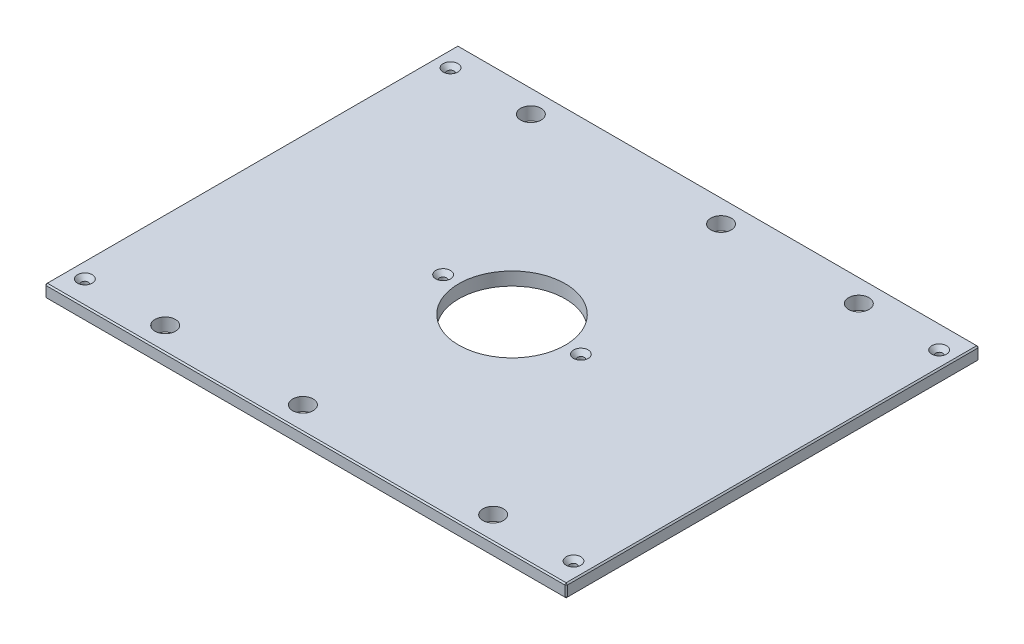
ISO-10303-21;
HEADER;
FILE_DESCRIPTION(('STEP AP214'),'2;1');
FILE_NAME('part.step','',(''),(''),'','','');
FILE_SCHEMA(('AUTOMOTIVE_DESIGN { 1 0 10303 214 1 1 1 1 }'));
ENDSEC;
DATA;
#1=APPLICATION_CONTEXT('core data for automotive mechanical design processes');
#2=APPLICATION_PROTOCOL_DEFINITION('international standard','automotive_design',2000,#1);
#3=PRODUCT_CONTEXT('',#1,'mechanical');
#4=PRODUCT('Part','Part','',(#3));
#5=PRODUCT_RELATED_PRODUCT_CATEGORY('part','',(#4));
#6=PRODUCT_DEFINITION_FORMATION('','',#4);
#7=PRODUCT_DEFINITION_CONTEXT('part definition',#1,'design');
#8=PRODUCT_DEFINITION('design','',#6,#7);
#9=PRODUCT_DEFINITION_SHAPE('','',#8);
#10=(LENGTH_UNIT() NAMED_UNIT(*) SI_UNIT(.MILLI.,.METRE.));
#11=(NAMED_UNIT(*) PLANE_ANGLE_UNIT() SI_UNIT($,.RADIAN.));
#12=(NAMED_UNIT(*) SI_UNIT($,.STERADIAN.) SOLID_ANGLE_UNIT());
#13=UNCERTAINTY_MEASURE_WITH_UNIT(LENGTH_MEASURE(1.E-05),#10,'distance_accuracy_value','');
#14=(GEOMETRIC_REPRESENTATION_CONTEXT(3) GLOBAL_UNCERTAINTY_ASSIGNED_CONTEXT((#13)) GLOBAL_UNIT_ASSIGNED_CONTEXT((#10,
#11,#12)) REPRESENTATION_CONTEXT('',''));
#15=CARTESIAN_POINT('',(0.,0.,0.));
#16=DIRECTION('',(0.,0.,1.));
#17=DIRECTION('',(1.,0.,0.));
#18=AXIS2_PLACEMENT_3D('',#15,#16,#17);
#19=CARTESIAN_POINT('',(-252.4125,12.7,-200.025));
#20=DIRECTION('',(1.,0.,0.));
#21=DIRECTION('',(0.,0.,-1.));
#22=AXIS2_PLACEMENT_3D('',#19,#20,#21);
#23=PLANE('',#22);
#24=DIRECTION('',(0.,0.,-1.));
#25=VECTOR('',#24,1.);
#26=CARTESIAN_POINT('',(-252.4125,11.4299999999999,-200.025));
#27=LINE('',#26,#25);
#28=CARTESIAN_POINT('',(-252.4125,11.4299999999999,198.755));
#29=VERTEX_POINT('',#28);
#30=CARTESIAN_POINT('',(-252.4125,11.4299999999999,-198.755));
#31=VERTEX_POINT('',#30);
#32=EDGE_CURVE('E135',#29,#31,#27,.T.);
#33=ORIENTED_EDGE('',*,*,#32,.T.);
#34=DIRECTION('',(0.,-1.,0.));
#35=VECTOR('',#34,1.);
#36=CARTESIAN_POINT('',(-252.4125,12.7,-198.755));
#37=LINE('',#36,#35);
#38=CARTESIAN_POINT('',(-252.4125,1.27000000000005,-198.755));
#39=VERTEX_POINT('',#38);
#40=EDGE_CURVE('E131',#31,#39,#37,.T.);
#41=ORIENTED_EDGE('',*,*,#40,.T.);
#42=DIRECTION('',(0.,0.,1.));
#43=VECTOR('',#42,1.);
#44=CARTESIAN_POINT('',(-252.4125,1.27000000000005,-200.025));
#45=LINE('',#44,#43);
#46=CARTESIAN_POINT('',(-252.4125,1.27000000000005,198.755));
#47=VERTEX_POINT('',#46);
#48=EDGE_CURVE('E126',#39,#47,#45,.T.);
#49=ORIENTED_EDGE('',*,*,#48,.T.);
#50=DIRECTION('',(0.,1.,0.));
#51=VECTOR('',#50,1.);
#52=CARTESIAN_POINT('',(-252.4125,12.7,198.755));
#53=LINE('',#52,#51);
#54=EDGE_CURVE('E128',#47,#29,#53,.T.);
#55=ORIENTED_EDGE('',*,*,#54,.T.);
#56=EDGE_LOOP('',(#33,#41,#49,#55));
#57=FACE_BOUND('',#56,.T.);
#58=ADVANCED_FACE('F35',(#57),#23,.F.);
#59=CARTESIAN_POINT('',(-252.4125,12.7,200.025));
#60=DIRECTION('',(0.,0.,-1.));
#61=DIRECTION('',(-1.,0.,0.));
#62=AXIS2_PLACEMENT_3D('',#59,#60,#61);
#63=PLANE('',#62);
#64=DIRECTION('',(1.,0.,0.));
#65=VECTOR('',#64,1.);
#66=CARTESIAN_POINT('',(-252.4125,1.26999999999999,200.025));
#67=LINE('',#66,#65);
#68=CARTESIAN_POINT('',(-251.1425,1.26999999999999,200.025));
#69=VERTEX_POINT('',#68);
#70=CARTESIAN_POINT('',(251.1425,1.26999999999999,200.025));
#71=VERTEX_POINT('',#70);
#72=EDGE_CURVE('E58',#69,#71,#67,.T.);
#73=ORIENTED_EDGE('',*,*,#72,.T.);
#74=DIRECTION('',(0.,1.,0.));
#75=VECTOR('',#74,1.);
#76=CARTESIAN_POINT('',(251.1425,12.7,200.025));
#77=LINE('',#76,#75);
#78=CARTESIAN_POINT('',(251.1425,11.43,200.025));
#79=VERTEX_POINT('',#78);
#80=EDGE_CURVE('E11',#71,#79,#77,.T.);
#81=ORIENTED_EDGE('',*,*,#80,.T.);
#82=DIRECTION('',(-1.,0.,0.));
#83=VECTOR('',#82,1.);
#84=CARTESIAN_POINT('',(-252.4125,11.43,200.025));
#85=LINE('',#84,#83);
#86=CARTESIAN_POINT('',(-251.1425,11.43,200.025));
#87=VERTEX_POINT('',#86);
#88=EDGE_CURVE('E44',#79,#87,#85,.T.);
#89=ORIENTED_EDGE('',*,*,#88,.T.);
#90=DIRECTION('',(0.,-1.,0.));
#91=VECTOR('',#90,1.);
#92=CARTESIAN_POINT('',(-251.1425,12.7,200.025));
#93=LINE('',#92,#91);
#94=EDGE_CURVE('E291',#87,#69,#93,.T.);
#95=ORIENTED_EDGE('',*,*,#94,.T.);
#96=EDGE_LOOP('',(#73,#81,#89,#95));
#97=FACE_BOUND('',#96,.T.);
#98=ADVANCED_FACE('F360',(#97),#63,.F.);
#99=CARTESIAN_POINT('',(252.4125,12.7,-200.025));
#100=DIRECTION('',(-1.,0.,0.));
#101=DIRECTION('',(0.,0.,1.));
#102=AXIS2_PLACEMENT_3D('',#99,#100,#101);
#103=PLANE('',#102);
#104=DIRECTION('',(0.,0.,-1.));
#105=VECTOR('',#104,1.);
#106=CARTESIAN_POINT('',(252.4125,1.26999999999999,-200.025));
#107=LINE('',#106,#105);
#108=CARTESIAN_POINT('',(252.4125,1.26999999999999,198.755));
#109=VERTEX_POINT('',#108);
#110=CARTESIAN_POINT('',(252.4125,1.26999999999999,-198.755));
#111=VERTEX_POINT('',#110);
#112=EDGE_CURVE('E286',#109,#111,#107,.T.);
#113=ORIENTED_EDGE('',*,*,#112,.T.);
#114=DIRECTION('',(0.,1.,0.));
#115=VECTOR('',#114,1.);
#116=CARTESIAN_POINT('',(252.4125,12.7,-198.755));
#117=LINE('',#116,#115);
#118=CARTESIAN_POINT('',(252.4125,11.4299999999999,-198.755));
#119=VERTEX_POINT('',#118);
#120=EDGE_CURVE('E288',#111,#119,#117,.T.);
#121=ORIENTED_EDGE('',*,*,#120,.T.);
#122=DIRECTION('',(0.,0.,1.));
#123=VECTOR('',#122,1.);
#124=CARTESIAN_POINT('',(252.4125,11.4299999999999,200.025));
#125=LINE('',#124,#123);
#126=CARTESIAN_POINT('',(252.4125,11.4299999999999,198.755));
#127=VERTEX_POINT('',#126);
#128=EDGE_CURVE('E284',#119,#127,#125,.T.);
#129=ORIENTED_EDGE('',*,*,#128,.T.);
#130=DIRECTION('',(0.,-1.,0.));
#131=VECTOR('',#130,1.);
#132=CARTESIAN_POINT('',(252.4125,12.7,198.755));
#133=LINE('',#132,#131);
#134=EDGE_CURVE('E282',#127,#109,#133,.T.);
#135=ORIENTED_EDGE('',*,*,#134,.T.);
#136=EDGE_LOOP('',(#113,#121,#129,#135));
#137=FACE_BOUND('',#136,.T.);
#138=ADVANCED_FACE('F347',(#137),#103,.F.);
#139=CARTESIAN_POINT('',(-252.4125,12.7,-200.025));
#140=DIRECTION('',(0.,0.,1.));
#141=DIRECTION('',(1.,0.,0.));
#142=AXIS2_PLACEMENT_3D('',#139,#140,#141);
#143=PLANE('',#142);
#144=DIRECTION('',(-1.,0.,0.));
#145=VECTOR('',#144,1.);
#146=CARTESIAN_POINT('',(-252.4125,1.26999999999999,-200.025));
#147=LINE('',#146,#145);
#148=CARTESIAN_POINT('',(251.1425,1.26999999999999,-200.025));
#149=VERTEX_POINT('',#148);
#150=CARTESIAN_POINT('',(-251.1425,1.26999999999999,-200.025));
#151=VERTEX_POINT('',#150);
#152=EDGE_CURVE('E258',#149,#151,#147,.T.);
#153=ORIENTED_EDGE('',*,*,#152,.T.);
#154=DIRECTION('',(0.,1.,0.));
#155=VECTOR('',#154,1.);
#156=CARTESIAN_POINT('',(-251.1425,12.7,-200.025));
#157=LINE('',#156,#155);
#158=CARTESIAN_POINT('',(-251.1425,11.4299999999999,-200.025));
#159=VERTEX_POINT('',#158);
#160=EDGE_CURVE('E262',#151,#159,#157,.T.);
#161=ORIENTED_EDGE('',*,*,#160,.T.);
#162=DIRECTION('',(1.,0.,0.));
#163=VECTOR('',#162,1.);
#164=CARTESIAN_POINT('',(252.4125,11.4299999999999,-200.025));
#165=LINE('',#164,#163);
#166=CARTESIAN_POINT('',(251.1425,11.4299999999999,-200.025));
#167=VERTEX_POINT('',#166);
#168=EDGE_CURVE('E260',#159,#167,#165,.T.);
#169=ORIENTED_EDGE('',*,*,#168,.T.);
#170=DIRECTION('',(0.,-1.,0.));
#171=VECTOR('',#170,1.);
#172=CARTESIAN_POINT('',(251.1425,12.7,-200.025));
#173=LINE('',#172,#171);
#174=EDGE_CURVE('E256',#167,#149,#173,.T.);
#175=ORIENTED_EDGE('',*,*,#174,.T.);
#176=EDGE_LOOP('',(#153,#161,#169,#175));
#177=FACE_BOUND('',#176,.T.);
#178=ADVANCED_FACE('F321',(#177),#143,.F.);
#179=CARTESIAN_POINT('',(0.,12.7,0.));
#180=DIRECTION('',(0.,1.,0.));
#181=DIRECTION('',(0.,0.,1.));
#182=AXIS2_PLACEMENT_3D('',#179,#180,#181);
#183=PLANE('',#182);
#184=CARTESIAN_POINT('',(236.5375,12.7,-177.00498));
#185=DIRECTION('',(0.,1.,0.));
#186=DIRECTION('',(0.,0.,1.));
#187=AXIS2_PLACEMENT_3D('',#184,#185,#186);
#188=CIRCLE('',#187,7.13739999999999);
#189=CARTESIAN_POINT('',(236.5375,12.7,-169.86758));
#190=VERTEX_POINT('',#189);
#191=EDGE_CURVE('E784',#190,#190,#188,.T.);
#192=ORIENTED_EDGE('',*,*,#191,.F.);
#193=EDGE_LOOP('',(#192));
#194=FACE_BOUND('',#193,.T.);
#195=CARTESIAN_POINT('',(236.5375,12.7,177.00498));
#196=DIRECTION('',(0.,1.,0.));
#197=DIRECTION('',(0.,0.,1.));
#198=AXIS2_PLACEMENT_3D('',#195,#196,#197);
#199=CIRCLE('',#198,7.13739999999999);
#200=CARTESIAN_POINT('',(236.5375,12.7,184.14238));
#201=VERTEX_POINT('',#200);
#202=EDGE_CURVE('E788',#201,#201,#199,.T.);
#203=ORIENTED_EDGE('',*,*,#202,.F.);
#204=EDGE_LOOP('',(#203));
#205=FACE_BOUND('',#204,.T.);
#206=CARTESIAN_POINT('',(-236.5375,12.7,177.00498));
#207=DIRECTION('',(0.,1.,0.));
#208=DIRECTION('',(0.,0.,1.));
#209=AXIS2_PLACEMENT_3D('',#206,#207,#208);
#210=CIRCLE('',#209,7.13739999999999);
#211=CARTESIAN_POINT('',(-236.5375,12.7,184.14238));
#212=VERTEX_POINT('',#211);
#213=EDGE_CURVE('E792',#212,#212,#210,.T.);
#214=ORIENTED_EDGE('',*,*,#213,.F.);
#215=EDGE_LOOP('',(#214));
#216=FACE_BOUND('',#215,.T.);
#217=CARTESIAN_POINT('',(-66.675,12.7,0.));
#218=DIRECTION('',(0.,1.,0.));
#219=DIRECTION('',(0.,0.,1.));
#220=AXIS2_PLACEMENT_3D('',#217,#218,#219);
#221=CIRCLE('',#220,7.1374);
#222=CARTESIAN_POINT('',(-66.675,12.7,7.1374));
#223=VERTEX_POINT('',#222);
#224=EDGE_CURVE('E796',#223,#223,#221,.T.);
#225=ORIENTED_EDGE('',*,*,#224,.F.);
#226=EDGE_LOOP('',(#225));
#227=FACE_BOUND('',#226,.T.);
#228=CARTESIAN_POINT('',(66.675,12.7,0.));
#229=DIRECTION('',(0.,1.,0.));
#230=DIRECTION('',(0.,0.,1.));
#231=AXIS2_PLACEMENT_3D('',#228,#229,#230);
#232=CIRCLE('',#231,7.1374);
#233=CARTESIAN_POINT('',(66.675,12.7,7.1374));
#234=VERTEX_POINT('',#233);
#235=EDGE_CURVE('E800',#234,#234,#232,.T.);
#236=ORIENTED_EDGE('',*,*,#235,.F.);
#237=EDGE_LOOP('',(#236));
#238=FACE_BOUND('',#237,.T.);
#239=CARTESIAN_POINT('',(-236.5375,12.7,-177.00498));
#240=DIRECTION('',(0.,1.,0.));
#241=DIRECTION('',(0.,0.,1.));
#242=AXIS2_PLACEMENT_3D('',#239,#240,#241);
#243=CIRCLE('',#242,7.13739999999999);
#244=CARTESIAN_POINT('',(-236.5375,12.7,-169.86758));
#245=VERTEX_POINT('',#244);
#246=EDGE_CURVE('E803',#245,#245,#243,.T.);
#247=ORIENTED_EDGE('',*,*,#246,.F.);
#248=EDGE_LOOP('',(#247));
#249=FACE_BOUND('',#248,.T.);
#250=DIRECTION('',(0.,0.,-1.));
#251=VECTOR('',#250,1.);
#252=CARTESIAN_POINT('',(251.1425,12.7,-200.025));
#253=LINE('',#252,#251);
#254=CARTESIAN_POINT('',(251.1425,12.7,198.755));
#255=VERTEX_POINT('',#254);
#256=CARTESIAN_POINT('',(251.1425,12.7,-198.755));
#257=VERTEX_POINT('',#256);
#258=EDGE_CURVE('E269',#255,#257,#253,.T.);
#259=ORIENTED_EDGE('',*,*,#258,.T.);
#260=DIRECTION('',(-1.,0.,0.));
#261=VECTOR('',#260,1.);
#262=CARTESIAN_POINT('',(-252.4125,12.7,-198.755));
#263=LINE('',#262,#261);
#264=CARTESIAN_POINT('',(-251.1425,12.7,-198.755));
#265=VERTEX_POINT('',#264);
#266=EDGE_CURVE('E271',#257,#265,#263,.T.);
#267=ORIENTED_EDGE('',*,*,#266,.T.);
#268=DIRECTION('',(0.,0.,1.));
#269=VECTOR('',#268,1.);
#270=CARTESIAN_POINT('',(-251.1425,12.7,200.025));
#271=LINE('',#270,#269);
#272=CARTESIAN_POINT('',(-251.1425,12.7,198.755));
#273=VERTEX_POINT('',#272);
#274=EDGE_CURVE('E267',#265,#273,#271,.T.);
#275=ORIENTED_EDGE('',*,*,#274,.T.);
#276=DIRECTION('',(1.,0.,0.));
#277=VECTOR('',#276,1.);
#278=CARTESIAN_POINT('',(252.4125,12.7,198.755));
#279=LINE('',#278,#277);
#280=EDGE_CURVE('E265',#273,#255,#279,.T.);
#281=ORIENTED_EDGE('',*,*,#280,.T.);
#282=EDGE_LOOP('',(#259,#267,#275,#281));
#283=FACE_BOUND('',#282,.T.);
#284=CARTESIAN_POINT('',(158.75,12.7,-177.00498));
#285=DIRECTION('',(0.,1.,0.));
#286=DIRECTION('',(0.,0.,1.));
#287=AXIS2_PLACEMENT_3D('',#284,#285,#286);
#288=CIRCLE('',#287,9.921875);
#289=CARTESIAN_POINT('',(158.75,12.7,-167.083105));
#290=VERTEX_POINT('',#289);
#291=EDGE_CURVE('E204',#290,#290,#288,.T.);
#292=ORIENTED_EDGE('',*,*,#291,.F.);
#293=EDGE_LOOP('',(#292));
#294=FACE_BOUND('',#293,.T.);
#295=CARTESIAN_POINT('',(-158.75,12.7,-177.00498));
#296=DIRECTION('',(0.,1.,0.));
#297=DIRECTION('',(0.,0.,1.));
#298=AXIS2_PLACEMENT_3D('',#295,#296,#297);
#299=CIRCLE('',#298,9.921875);
#300=CARTESIAN_POINT('',(-158.75,12.7,-167.083105));
#301=VERTEX_POINT('',#300);
#302=EDGE_CURVE('E214',#301,#301,#299,.T.);
#303=ORIENTED_EDGE('',*,*,#302,.F.);
#304=EDGE_LOOP('',(#303));
#305=FACE_BOUND('',#304,.T.);
#306=CARTESIAN_POINT('',(158.75,12.7,177.00498));
#307=DIRECTION('',(0.,1.,0.));
#308=DIRECTION('',(0.,0.,1.));
#309=AXIS2_PLACEMENT_3D('',#306,#307,#308);
#310=CIRCLE('',#309,9.921875);
#311=CARTESIAN_POINT('',(158.75,12.7,186.926855));
#312=VERTEX_POINT('',#311);
#313=EDGE_CURVE('E225',#312,#312,#310,.T.);
#314=ORIENTED_EDGE('',*,*,#313,.F.);
#315=EDGE_LOOP('',(#314));
#316=FACE_BOUND('',#315,.T.);
#317=CARTESIAN_POINT('',(-158.75,12.7,177.00498));
#318=DIRECTION('',(0.,1.,0.));
#319=DIRECTION('',(0.,0.,1.));
#320=AXIS2_PLACEMENT_3D('',#317,#318,#319);
#321=CIRCLE('',#320,9.921875);
#322=CARTESIAN_POINT('',(-158.75,12.7,186.926855));
#323=VERTEX_POINT('',#322);
#324=EDGE_CURVE('E231',#323,#323,#321,.T.);
#325=ORIENTED_EDGE('',*,*,#324,.F.);
#326=EDGE_LOOP('',(#325));
#327=FACE_BOUND('',#326,.T.);
#328=CARTESIAN_POINT('',(25.4,12.7,-177.00498));
#329=DIRECTION('',(0.,1.,0.));
#330=DIRECTION('',(0.,0.,1.));
#331=AXIS2_PLACEMENT_3D('',#328,#329,#330);
#332=CIRCLE('',#331,9.921875);
#333=CARTESIAN_POINT('',(25.4,12.7,-167.083105));
#334=VERTEX_POINT('',#333);
#335=EDGE_CURVE('E237',#334,#334,#332,.T.);
#336=ORIENTED_EDGE('',*,*,#335,.F.);
#337=EDGE_LOOP('',(#336));
#338=FACE_BOUND('',#337,.T.);
#339=CARTESIAN_POINT('',(-25.4,12.7,177.00498));
#340=DIRECTION('',(0.,1.,0.));
#341=DIRECTION('',(0.,0.,1.));
#342=AXIS2_PLACEMENT_3D('',#339,#340,#341);
#343=CIRCLE('',#342,9.921875);
#344=CARTESIAN_POINT('',(-25.4,12.7,186.926855));
#345=VERTEX_POINT('',#344);
#346=EDGE_CURVE('E243',#345,#345,#343,.T.);
#347=ORIENTED_EDGE('',*,*,#346,.F.);
#348=EDGE_LOOP('',(#347));
#349=FACE_BOUND('',#348,.T.);
#350=CARTESIAN_POINT('',(0.,12.7,0.));
#351=DIRECTION('',(0.,1.,0.));
#352=DIRECTION('',(0.,0.,1.));
#353=AXIS2_PLACEMENT_3D('',#350,#351,#352);
#354=CIRCLE('',#353,51.562);
#355=CARTESIAN_POINT('',(0.,12.7,51.562));
#356=VERTEX_POINT('',#355);
#357=EDGE_CURVE('E249',#356,#356,#354,.T.);
#358=ORIENTED_EDGE('',*,*,#357,.F.);
#359=EDGE_LOOP('',(#358));
#360=FACE_BOUND('',#359,.T.);
#361=ADVANCED_FACE('F369',(#194,#205,#216,#227,#238,#249,#283,#294,#305,#316,#327,#338,#349,
#360),#183,.T.);
#362=CARTESIAN_POINT('',(0.,0.,0.));
#363=DIRECTION('',(0.,1.,0.));
#364=DIRECTION('',(0.,0.,1.));
#365=AXIS2_PLACEMENT_3D('',#362,#363,#364);
#366=PLANE('',#365);
#367=CARTESIAN_POINT('',(236.5375,0.,-177.00498));
#368=DIRECTION('',(0.,1.,0.));
#369=DIRECTION('',(0.,0.,1.));
#370=AXIS2_PLACEMENT_3D('',#367,#368,#369);
#371=CIRCLE('',#370,3.3782);
#372=CARTESIAN_POINT('',(236.5375,0.,-173.62678));
#373=VERTEX_POINT('',#372);
#374=EDGE_CURVE('E837',#373,#373,#371,.T.);
#375=ORIENTED_EDGE('',*,*,#374,.T.);
#376=EDGE_LOOP('',(#375));
#377=FACE_BOUND('',#376,.T.);
#378=CARTESIAN_POINT('',(236.5375,0.,177.00498));
#379=DIRECTION('',(0.,1.,0.));
#380=DIRECTION('',(0.,0.,1.));
#381=AXIS2_PLACEMENT_3D('',#378,#379,#380);
#382=CIRCLE('',#381,3.3782);
#383=CARTESIAN_POINT('',(236.5375,0.,180.38318));
#384=VERTEX_POINT('',#383);
#385=EDGE_CURVE('E830',#384,#384,#382,.T.);
#386=ORIENTED_EDGE('',*,*,#385,.T.);
#387=EDGE_LOOP('',(#386));
#388=FACE_BOUND('',#387,.T.);
#389=CARTESIAN_POINT('',(-236.5375,0.,177.00498));
#390=DIRECTION('',(0.,1.,0.));
#391=DIRECTION('',(0.,0.,1.));
#392=AXIS2_PLACEMENT_3D('',#389,#390,#391);
#393=CIRCLE('',#392,3.3782);
#394=CARTESIAN_POINT('',(-236.5375,0.,180.38318));
#395=VERTEX_POINT('',#394);
#396=EDGE_CURVE('E823',#395,#395,#393,.T.);
#397=ORIENTED_EDGE('',*,*,#396,.T.);
#398=EDGE_LOOP('',(#397));
#399=FACE_BOUND('',#398,.T.);
#400=CARTESIAN_POINT('',(-66.675,0.,0.));
#401=DIRECTION('',(0.,1.,0.));
#402=DIRECTION('',(0.,0.,1.));
#403=AXIS2_PLACEMENT_3D('',#400,#401,#402);
#404=CIRCLE('',#403,3.3782);
#405=CARTESIAN_POINT('',(-66.675,0.,3.3782));
#406=VERTEX_POINT('',#405);
#407=EDGE_CURVE('E816',#406,#406,#404,.T.);
#408=ORIENTED_EDGE('',*,*,#407,.T.);
#409=EDGE_LOOP('',(#408));
#410=FACE_BOUND('',#409,.T.);
#411=CARTESIAN_POINT('',(66.675,0.,0.));
#412=DIRECTION('',(0.,1.,0.));
#413=DIRECTION('',(0.,0.,1.));
#414=AXIS2_PLACEMENT_3D('',#411,#412,#413);
#415=CIRCLE('',#414,3.3782);
#416=CARTESIAN_POINT('',(66.675,0.,3.3782));
#417=VERTEX_POINT('',#416);
#418=EDGE_CURVE('E806',#417,#417,#415,.T.);
#419=ORIENTED_EDGE('',*,*,#418,.T.);
#420=EDGE_LOOP('',(#419));
#421=FACE_BOUND('',#420,.T.);
#422=CARTESIAN_POINT('',(-236.5375,0.,-177.00498));
#423=DIRECTION('',(0.,1.,0.));
#424=DIRECTION('',(0.,0.,1.));
#425=AXIS2_PLACEMENT_3D('',#422,#423,#424);
#426=CIRCLE('',#425,3.3782);
#427=CARTESIAN_POINT('',(-236.5375,0.,-173.62678));
#428=VERTEX_POINT('',#427);
#429=EDGE_CURVE('E217',#428,#428,#426,.T.);
#430=ORIENTED_EDGE('',*,*,#429,.T.);
#431=EDGE_LOOP('',(#430));
#432=FACE_BOUND('',#431,.T.);
#433=DIRECTION('',(0.,0.,-1.));
#434=VECTOR('',#433,1.);
#435=CARTESIAN_POINT('',(-251.1425,0.,0.));
#436=LINE('',#435,#434);
#437=CARTESIAN_POINT('',(-251.1425,0.,198.755));
#438=VERTEX_POINT('',#437);
#439=CARTESIAN_POINT('',(-251.1425,0.,-198.755));
#440=VERTEX_POINT('',#439);
#441=EDGE_CURVE('E158',#438,#440,#436,.T.);
#442=ORIENTED_EDGE('',*,*,#441,.T.);
#443=DIRECTION('',(1.,0.,0.));
#444=VECTOR('',#443,1.);
#445=CARTESIAN_POINT('',(0.,0.,-198.755));
#446=LINE('',#445,#444);
#447=CARTESIAN_POINT('',(251.1425,0.,-198.755));
#448=VERTEX_POINT('',#447);
#449=EDGE_CURVE('E279',#440,#448,#446,.T.);
#450=ORIENTED_EDGE('',*,*,#449,.T.);
#451=DIRECTION('',(0.,0.,1.));
#452=VECTOR('',#451,1.);
#453=CARTESIAN_POINT('',(251.1425,0.,0.));
#454=LINE('',#453,#452);
#455=CARTESIAN_POINT('',(251.1425,0.,198.755));
#456=VERTEX_POINT('',#455);
#457=EDGE_CURVE('E277',#448,#456,#454,.T.);
#458=ORIENTED_EDGE('',*,*,#457,.T.);
#459=DIRECTION('',(-1.,0.,0.));
#460=VECTOR('',#459,1.);
#461=CARTESIAN_POINT('',(0.,0.,198.755));
#462=LINE('',#461,#460);
#463=EDGE_CURVE('E274',#456,#438,#462,.T.);
#464=ORIENTED_EDGE('',*,*,#463,.T.);
#465=EDGE_LOOP('',(#442,#450,#458,#464));
#466=FACE_BOUND('',#465,.T.);
#467=CARTESIAN_POINT('',(158.75,0.,-177.00498));
#468=DIRECTION('',(0.,1.,0.));
#469=DIRECTION('',(0.,0.,1.));
#470=AXIS2_PLACEMENT_3D('',#467,#468,#469);
#471=CIRCLE('',#470,9.921875);
#472=CARTESIAN_POINT('',(158.75,0.,-167.083105));
#473=VERTEX_POINT('',#472);
#474=EDGE_CURVE('E209',#473,#473,#471,.T.);
#475=ORIENTED_EDGE('',*,*,#474,.T.);
#476=EDGE_LOOP('',(#475));
#477=FACE_BOUND('',#476,.T.);
#478=CARTESIAN_POINT('',(-158.75,0.,-177.00498));
#479=DIRECTION('',(0.,1.,0.));
#480=DIRECTION('',(0.,0.,1.));
#481=AXIS2_PLACEMENT_3D('',#478,#479,#480);
#482=CIRCLE('',#481,9.921875);
#483=CARTESIAN_POINT('',(-158.75,0.,-167.083105));
#484=VERTEX_POINT('',#483);
#485=EDGE_CURVE('E222',#484,#484,#482,.T.);
#486=ORIENTED_EDGE('',*,*,#485,.T.);
#487=EDGE_LOOP('',(#486));
#488=FACE_BOUND('',#487,.T.);
#489=CARTESIAN_POINT('',(158.75,0.,177.00498));
#490=DIRECTION('',(0.,1.,0.));
#491=DIRECTION('',(0.,0.,1.));
#492=AXIS2_PLACEMENT_3D('',#489,#490,#491);
#493=CIRCLE('',#492,9.921875);
#494=CARTESIAN_POINT('',(158.75,0.,186.926855));
#495=VERTEX_POINT('',#494);
#496=EDGE_CURVE('E228',#495,#495,#493,.T.);
#497=ORIENTED_EDGE('',*,*,#496,.T.);
#498=EDGE_LOOP('',(#497));
#499=FACE_BOUND('',#498,.T.);
#500=CARTESIAN_POINT('',(-158.75,0.,177.00498));
#501=DIRECTION('',(0.,1.,0.));
#502=DIRECTION('',(0.,0.,1.));
#503=AXIS2_PLACEMENT_3D('',#500,#501,#502);
#504=CIRCLE('',#503,9.921875);
#505=CARTESIAN_POINT('',(-158.75,0.,186.926855));
#506=VERTEX_POINT('',#505);
#507=EDGE_CURVE('E234',#506,#506,#504,.T.);
#508=ORIENTED_EDGE('',*,*,#507,.T.);
#509=EDGE_LOOP('',(#508));
#510=FACE_BOUND('',#509,.T.);
#511=CARTESIAN_POINT('',(25.4,0.,-177.00498));
#512=DIRECTION('',(0.,1.,0.));
#513=DIRECTION('',(0.,0.,1.));
#514=AXIS2_PLACEMENT_3D('',#511,#512,#513);
#515=CIRCLE('',#514,9.921875);
#516=CARTESIAN_POINT('',(25.4,0.,-167.083105));
#517=VERTEX_POINT('',#516);
#518=EDGE_CURVE('E240',#517,#517,#515,.T.);
#519=ORIENTED_EDGE('',*,*,#518,.T.);
#520=EDGE_LOOP('',(#519));
#521=FACE_BOUND('',#520,.T.);
#522=CARTESIAN_POINT('',(-25.4,0.,177.00498));
#523=DIRECTION('',(0.,1.,0.));
#524=DIRECTION('',(0.,0.,1.));
#525=AXIS2_PLACEMENT_3D('',#522,#523,#524);
#526=CIRCLE('',#525,9.921875);
#527=CARTESIAN_POINT('',(-25.4,0.,186.926855));
#528=VERTEX_POINT('',#527);
#529=EDGE_CURVE('E246',#528,#528,#526,.T.);
#530=ORIENTED_EDGE('',*,*,#529,.T.);
#531=EDGE_LOOP('',(#530));
#532=FACE_BOUND('',#531,.T.);
#533=CARTESIAN_POINT('',(0.,0.,0.));
#534=DIRECTION('',(0.,1.,0.));
#535=DIRECTION('',(0.,0.,1.));
#536=AXIS2_PLACEMENT_3D('',#533,#534,#535);
#537=CIRCLE('',#536,51.562);
#538=CARTESIAN_POINT('',(0.,0.,51.562));
#539=VERTEX_POINT('',#538);
#540=EDGE_CURVE('E147',#539,#539,#537,.T.);
#541=ORIENTED_EDGE('',*,*,#540,.T.);
#542=EDGE_LOOP('',(#541));
#543=FACE_BOUND('',#542,.T.);
#544=ADVANCED_FACE('F334',(#377,#388,#399,#410,#421,#432,#466,#477,#488,#499,#510,#521,#532,
#543),#366,.F.);
#545=CARTESIAN_POINT('',(0.,0.,0.));
#546=DIRECTION('',(0.,1.,0.));
#547=DIRECTION('',(0.,0.,1.));
#548=AXIS2_PLACEMENT_3D('',#545,#546,#547);
#549=CYLINDRICAL_SURFACE('',#548,51.562);
#550=ORIENTED_EDGE('',*,*,#540,.F.);
#551=EDGE_LOOP('',(#550));
#552=FACE_BOUND('',#551,.T.);
#553=ORIENTED_EDGE('',*,*,#357,.T.);
#554=EDGE_LOOP('',(#553));
#555=FACE_BOUND('',#554,.T.);
#556=ADVANCED_FACE('F721',(#552,#555),#549,.F.);
#557=CARTESIAN_POINT('',(-25.4,12.7,177.00498));
#558=DIRECTION('',(0.,1.,0.));
#559=DIRECTION('',(0.,0.,1.));
#560=AXIS2_PLACEMENT_3D('',#557,#558,#559);
#561=CYLINDRICAL_SURFACE('',#560,9.921875);
#562=ORIENTED_EDGE('',*,*,#529,.F.);
#563=EDGE_LOOP('',(#562));
#564=FACE_BOUND('',#563,.T.);
#565=ORIENTED_EDGE('',*,*,#346,.T.);
#566=EDGE_LOOP('',(#565));
#567=FACE_BOUND('',#566,.T.);
#568=ADVANCED_FACE('F712',(#564,#567),#561,.F.);
#569=CARTESIAN_POINT('',(25.4,12.7,-177.00498));
#570=DIRECTION('',(0.,1.,0.));
#571=DIRECTION('',(0.,0.,1.));
#572=AXIS2_PLACEMENT_3D('',#569,#570,#571);
#573=CYLINDRICAL_SURFACE('',#572,9.921875);
#574=ORIENTED_EDGE('',*,*,#518,.F.);
#575=EDGE_LOOP('',(#574));
#576=FACE_BOUND('',#575,.T.);
#577=ORIENTED_EDGE('',*,*,#335,.T.);
#578=EDGE_LOOP('',(#577));
#579=FACE_BOUND('',#578,.T.);
#580=ADVANCED_FACE('F703',(#576,#579),#573,.F.);
#581=CARTESIAN_POINT('',(-158.75,12.7,177.00498));
#582=DIRECTION('',(0.,1.,0.));
#583=DIRECTION('',(0.,0.,1.));
#584=AXIS2_PLACEMENT_3D('',#581,#582,#583);
#585=CYLINDRICAL_SURFACE('',#584,9.921875);
#586=ORIENTED_EDGE('',*,*,#507,.F.);
#587=EDGE_LOOP('',(#586));
#588=FACE_BOUND('',#587,.T.);
#589=ORIENTED_EDGE('',*,*,#324,.T.);
#590=EDGE_LOOP('',(#589));
#591=FACE_BOUND('',#590,.T.);
#592=ADVANCED_FACE('F694',(#588,#591),#585,.F.);
#593=CARTESIAN_POINT('',(158.75,12.7,177.00498));
#594=DIRECTION('',(0.,1.,0.));
#595=DIRECTION('',(0.,0.,1.));
#596=AXIS2_PLACEMENT_3D('',#593,#594,#595);
#597=CYLINDRICAL_SURFACE('',#596,9.921875);
#598=ORIENTED_EDGE('',*,*,#496,.F.);
#599=EDGE_LOOP('',(#598));
#600=FACE_BOUND('',#599,.T.);
#601=ORIENTED_EDGE('',*,*,#313,.T.);
#602=EDGE_LOOP('',(#601));
#603=FACE_BOUND('',#602,.T.);
#604=ADVANCED_FACE('F685',(#600,#603),#597,.F.);
#605=CARTESIAN_POINT('',(-158.75,12.7,-177.00498));
#606=DIRECTION('',(0.,1.,0.));
#607=DIRECTION('',(0.,0.,1.));
#608=AXIS2_PLACEMENT_3D('',#605,#606,#607);
#609=CYLINDRICAL_SURFACE('',#608,9.921875);
#610=ORIENTED_EDGE('',*,*,#485,.F.);
#611=EDGE_LOOP('',(#610));
#612=FACE_BOUND('',#611,.T.);
#613=ORIENTED_EDGE('',*,*,#302,.T.);
#614=EDGE_LOOP('',(#613));
#615=FACE_BOUND('',#614,.T.);
#616=ADVANCED_FACE('F675',(#612,#615),#609,.F.);
#617=CARTESIAN_POINT('',(158.75,12.7,-177.00498));
#618=DIRECTION('',(0.,1.,0.));
#619=DIRECTION('',(0.,0.,1.));
#620=AXIS2_PLACEMENT_3D('',#617,#618,#619);
#621=CYLINDRICAL_SURFACE('',#620,9.921875);
#622=ORIENTED_EDGE('',*,*,#474,.F.);
#623=EDGE_LOOP('',(#622));
#624=FACE_BOUND('',#623,.T.);
#625=ORIENTED_EDGE('',*,*,#291,.T.);
#626=EDGE_LOOP('',(#625));
#627=FACE_BOUND('',#626,.T.);
#628=ADVANCED_FACE('F378',(#624,#627),#621,.F.);
#629=CARTESIAN_POINT('',(252.4125,12.7,198.755));
#630=DIRECTION('',(-0.707106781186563,0.,-0.707106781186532));
#631=DIRECTION('',(0.,-1.,0.));
#632=AXIS2_PLACEMENT_3D('',#629,#630,#631);
#633=PLANE('',#632);
#634=DIRECTION('',(-0.707106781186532,0.,0.707106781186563));
#635=VECTOR('',#634,1.);
#636=CARTESIAN_POINT('',(252.4125,11.4299999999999,198.755));
#637=LINE('',#636,#635);
#638=EDGE_CURVE('E39',#79,#127,#637,.F.);
#639=ORIENTED_EDGE('',*,*,#638,.F.);
#640=ORIENTED_EDGE('',*,*,#80,.F.);
#641=DIRECTION('',(0.707106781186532,0.,-0.707106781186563));
#642=VECTOR('',#641,1.);
#643=CARTESIAN_POINT('',(251.7775,1.26999999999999,199.39));
#644=LINE('',#643,#642);
#645=EDGE_CURVE('E197',#109,#71,#644,.F.);
#646=ORIENTED_EDGE('',*,*,#645,.F.);
#647=ORIENTED_EDGE('',*,*,#134,.F.);
#648=EDGE_LOOP('',(#639,#640,#646,#647));
#649=FACE_BOUND('',#648,.T.);
#650=ADVANCED_FACE('F37',(#649),#633,.F.);
#651=CARTESIAN_POINT('',(252.4125,11.4299999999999,198.755));
#652=DIRECTION('',(0.577350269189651,0.577350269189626,0.577350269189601));
#653=DIRECTION('',(-0.707106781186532,0.707106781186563,0.));
#654=AXIS2_PLACEMENT_3D('',#651,#652,#653);
#655=PLANE('',#654);
#656=DIRECTION('',(0.,-0.707106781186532,0.707106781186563));
#657=VECTOR('',#656,1.);
#658=CARTESIAN_POINT('',(251.1425,12.065,199.39));
#659=LINE('',#658,#657);
#660=EDGE_CURVE('E193',#79,#255,#659,.F.);
#661=ORIENTED_EDGE('',*,*,#660,.F.);
#662=ORIENTED_EDGE('',*,*,#638,.T.);
#663=DIRECTION('',(-0.707106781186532,0.707106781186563,0.));
#664=VECTOR('',#663,1.);
#665=CARTESIAN_POINT('',(252.4125,11.4299999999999,198.755));
#666=LINE('',#665,#664);
#667=EDGE_CURVE('E195',#255,#127,#666,.F.);
#668=ORIENTED_EDGE('',*,*,#667,.F.);
#669=EDGE_LOOP('',(#661,#662,#668));
#670=FACE_BOUND('',#669,.T.);
#671=ADVANCED_FACE('F371',(#670),#655,.T.);
#672=CARTESIAN_POINT('',(251.1425,0.,198.755));
#673=DIRECTION('',(0.577350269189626,-0.577350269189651,0.577350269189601));
#674=DIRECTION('',(0.707106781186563,0.707106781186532,0.));
#675=AXIS2_PLACEMENT_3D('',#672,#673,#674);
#676=PLANE('',#675);
#677=DIRECTION('',(-0.707106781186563,-0.707106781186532,0.));
#678=VECTOR('',#677,1.);
#679=CARTESIAN_POINT('',(251.1425,0.,198.755));
#680=LINE('',#679,#678);
#681=EDGE_CURVE('E187',#109,#456,#680,.T.);
#682=ORIENTED_EDGE('',*,*,#681,.F.);
#683=ORIENTED_EDGE('',*,*,#645,.T.);
#684=DIRECTION('',(0.,0.707106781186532,0.707106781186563));
#685=VECTOR('',#684,1.);
#686=CARTESIAN_POINT('',(251.1425,0.,198.755));
#687=LINE('',#686,#685);
#688=EDGE_CURVE('E190',#456,#71,#687,.T.);
#689=ORIENTED_EDGE('',*,*,#688,.F.);
#690=EDGE_LOOP('',(#682,#683,#689));
#691=FACE_BOUND('',#690,.T.);
#692=ADVANCED_FACE('F340',(#691),#676,.T.);
#693=CARTESIAN_POINT('',(251.1425,12.7,0.));
#694=DIRECTION('',(0.707106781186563,0.707106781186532,0.));
#695=DIRECTION('',(0.,0.,1.));
#696=AXIS2_PLACEMENT_3D('',#693,#694,#695);
#697=PLANE('',#696);
#698=ORIENTED_EDGE('',*,*,#667,.T.);
#699=ORIENTED_EDGE('',*,*,#128,.F.);
#700=DIRECTION('',(0.707106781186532,-0.707106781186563,0.));
#701=VECTOR('',#700,1.);
#702=CARTESIAN_POINT('',(251.7775,12.065,-198.755));
#703=LINE('',#702,#701);
#704=EDGE_CURVE('E182',#257,#119,#703,.T.);
#705=ORIENTED_EDGE('',*,*,#704,.F.);
#706=ORIENTED_EDGE('',*,*,#258,.F.);
#707=EDGE_LOOP('',(#698,#699,#705,#706));
#708=FACE_BOUND('',#707,.T.);
#709=ADVANCED_FACE('F357',(#708),#697,.T.);
#710=CARTESIAN_POINT('',(0.,12.7,198.755));
#711=DIRECTION('',(0.,0.707106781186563,0.707106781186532));
#712=DIRECTION('',(-1.,0.,0.));
#713=AXIS2_PLACEMENT_3D('',#710,#711,#712);
#714=PLANE('',#713);
#715=ORIENTED_EDGE('',*,*,#660,.T.);
#716=ORIENTED_EDGE('',*,*,#280,.F.);
#717=DIRECTION('',(0.,0.707106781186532,-0.707106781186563));
#718=VECTOR('',#717,1.);
#719=CARTESIAN_POINT('',(-251.1425,12.7,198.755));
#720=LINE('',#719,#718);
#721=EDGE_CURVE('E179',#87,#273,#720,.T.);
#722=ORIENTED_EDGE('',*,*,#721,.F.);
#723=ORIENTED_EDGE('',*,*,#88,.F.);
#724=EDGE_LOOP('',(#715,#716,#722,#723));
#725=FACE_BOUND('',#724,.T.);
#726=ADVANCED_FACE('F362',(#725),#714,.T.);
#727=CARTESIAN_POINT('',(-251.1425,12.7,200.025));
#728=DIRECTION('',(0.707106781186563,0.,-0.707106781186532));
#729=DIRECTION('',(0.,-1.,0.));
#730=AXIS2_PLACEMENT_3D('',#727,#728,#729);
#731=PLANE('',#730);
#732=DIRECTION('',(0.707106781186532,0.,0.707106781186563));
#733=VECTOR('',#732,1.);
#734=CARTESIAN_POINT('',(-252.4125,1.27000000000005,198.755));
#735=LINE('',#734,#733);
#736=EDGE_CURVE('E142',#69,#47,#735,.F.);
#737=ORIENTED_EDGE('',*,*,#736,.F.);
#738=ORIENTED_EDGE('',*,*,#94,.F.);
#739=DIRECTION('',(-0.707106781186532,0.,-0.707106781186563));
#740=VECTOR('',#739,1.);
#741=CARTESIAN_POINT('',(-251.7775,11.43,199.39));
#742=LINE('',#741,#740);
#743=EDGE_CURVE('E145',#29,#87,#742,.F.);
#744=ORIENTED_EDGE('',*,*,#743,.F.);
#745=ORIENTED_EDGE('',*,*,#54,.F.);
#746=EDGE_LOOP('',(#737,#738,#744,#745));
#747=FACE_BOUND('',#746,.T.);
#748=ADVANCED_FACE('F140',(#747),#731,.F.);
#749=CARTESIAN_POINT('',(-252.4125,1.26999999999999,200.025));
#750=DIRECTION('',(0.,0.707106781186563,-0.707106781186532));
#751=DIRECTION('',(1.,0.,0.));
#752=AXIS2_PLACEMENT_3D('',#749,#750,#751);
#753=PLANE('',#752);
#754=ORIENTED_EDGE('',*,*,#688,.T.);
#755=ORIENTED_EDGE('',*,*,#72,.F.);
#756=DIRECTION('',(0.,-0.707106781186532,-0.707106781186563));
#757=VECTOR('',#756,1.);
#758=CARTESIAN_POINT('',(-251.1425,0.634999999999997,199.39));
#759=LINE('',#758,#757);
#760=EDGE_CURVE('E155',#438,#69,#759,.F.);
#761=ORIENTED_EDGE('',*,*,#760,.F.);
#762=ORIENTED_EDGE('',*,*,#463,.F.);
#763=EDGE_LOOP('',(#754,#755,#761,#762));
#764=FACE_BOUND('',#763,.T.);
#765=ADVANCED_FACE('F339',(#764),#753,.F.);
#766=CARTESIAN_POINT('',(252.4125,1.26999999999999,-200.025));
#767=DIRECTION('',(-0.707106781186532,0.707106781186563,0.));
#768=DIRECTION('',(0.,0.,-1.));
#769=AXIS2_PLACEMENT_3D('',#766,#767,#768);
#770=PLANE('',#769);
#771=ORIENTED_EDGE('',*,*,#681,.T.);
#772=ORIENTED_EDGE('',*,*,#457,.F.);
#773=DIRECTION('',(0.707106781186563,0.707106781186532,0.));
#774=VECTOR('',#773,1.);
#775=CARTESIAN_POINT('',(251.1425,0.,-198.755));
#776=LINE('',#775,#774);
#777=EDGE_CURVE('E174',#111,#448,#776,.F.);
#778=ORIENTED_EDGE('',*,*,#777,.F.);
#779=ORIENTED_EDGE('',*,*,#112,.F.);
#780=EDGE_LOOP('',(#771,#772,#778,#779));
#781=FACE_BOUND('',#780,.T.);
#782=ADVANCED_FACE('F344',(#781),#770,.F.);
#783=CARTESIAN_POINT('',(251.1425,12.7,-200.025));
#784=DIRECTION('',(-0.707106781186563,0.,0.707106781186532));
#785=DIRECTION('',(0.,-1.,0.));
#786=AXIS2_PLACEMENT_3D('',#783,#784,#785);
#787=PLANE('',#786);
#788=DIRECTION('',(0.707106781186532,0.,0.707106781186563));
#789=VECTOR('',#788,1.);
#790=CARTESIAN_POINT('',(251.1425,11.4299999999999,-200.025));
#791=LINE('',#790,#789);
#792=EDGE_CURVE('E184',#119,#167,#791,.F.);
#793=ORIENTED_EDGE('',*,*,#792,.F.);
#794=ORIENTED_EDGE('',*,*,#120,.F.);
#795=DIRECTION('',(-0.707106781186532,0.,-0.707106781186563));
#796=VECTOR('',#795,1.);
#797=CARTESIAN_POINT('',(251.7775,1.26999999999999,-199.39));
#798=LINE('',#797,#796);
#799=EDGE_CURVE('E171',#149,#111,#798,.F.);
#800=ORIENTED_EDGE('',*,*,#799,.F.);
#801=ORIENTED_EDGE('',*,*,#174,.F.);
#802=EDGE_LOOP('',(#793,#794,#800,#801));
#803=FACE_BOUND('',#802,.T.);
#804=ADVANCED_FACE('F352',(#803),#787,.F.);
#805=CARTESIAN_POINT('',(251.1425,11.4299999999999,-200.025));
#806=DIRECTION('',(0.577350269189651,0.577350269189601,-0.577350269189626));
#807=DIRECTION('',(-0.707106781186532,0.,-0.707106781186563));
#808=AXIS2_PLACEMENT_3D('',#805,#806,#807);
#809=PLANE('',#808);
#810=ORIENTED_EDGE('',*,*,#704,.T.);
#811=ORIENTED_EDGE('',*,*,#792,.T.);
#812=DIRECTION('',(0.,0.707106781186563,0.707106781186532));
#813=VECTOR('',#812,1.);
#814=CARTESIAN_POINT('',(251.1425,11.4299999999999,-200.025));
#815=LINE('',#814,#813);
#816=EDGE_CURVE('E163',#257,#167,#815,.F.);
#817=ORIENTED_EDGE('',*,*,#816,.F.);
#818=EDGE_LOOP('',(#810,#811,#817));
#819=FACE_BOUND('',#818,.T.);
#820=ADVANCED_FACE('F410',(#819),#809,.T.);
#821=CARTESIAN_POINT('',(-251.1425,12.7,198.755));
#822=DIRECTION('',(-0.577350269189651,0.577350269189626,0.577350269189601));
#823=DIRECTION('',(-0.707106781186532,-0.707106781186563,0.));
#824=AXIS2_PLACEMENT_3D('',#821,#822,#823);
#825=PLANE('',#824);
#826=ORIENTED_EDGE('',*,*,#743,.T.);
#827=ORIENTED_EDGE('',*,*,#721,.T.);
#828=DIRECTION('',(-0.707106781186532,-0.707106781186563,0.));
#829=VECTOR('',#828,1.);
#830=CARTESIAN_POINT('',(-251.1425,12.7,198.755));
#831=LINE('',#830,#829);
#832=EDGE_CURVE('E159',#29,#273,#831,.F.);
#833=ORIENTED_EDGE('',*,*,#832,.F.);
#834=EDGE_LOOP('',(#826,#827,#833));
#835=FACE_BOUND('',#834,.T.);
#836=ADVANCED_FACE('F364',(#835),#825,.T.);
#837=CARTESIAN_POINT('',(-252.4125,1.27000000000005,198.755));
#838=DIRECTION('',(-0.577350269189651,-0.577350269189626,0.577350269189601));
#839=DIRECTION('',(0.707106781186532,-0.707106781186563,0.));
#840=AXIS2_PLACEMENT_3D('',#837,#838,#839);
#841=PLANE('',#840);
#842=ORIENTED_EDGE('',*,*,#760,.T.);
#843=ORIENTED_EDGE('',*,*,#736,.T.);
#844=DIRECTION('',(-0.707106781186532,0.707106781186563,0.));
#845=VECTOR('',#844,1.);
#846=CARTESIAN_POINT('',(-252.4125,1.27000000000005,198.755));
#847=LINE('',#846,#845);
#848=EDGE_CURVE('E152',#438,#47,#847,.T.);
#849=ORIENTED_EDGE('',*,*,#848,.F.);
#850=EDGE_LOOP('',(#842,#843,#849));
#851=FACE_BOUND('',#850,.T.);
#852=ADVANCED_FACE('F151',(#851),#841,.T.);
#853=CARTESIAN_POINT('',(251.1425,0.,-198.755));
#854=DIRECTION('',(0.577350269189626,-0.577350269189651,-0.577350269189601));
#855=DIRECTION('',(0.707106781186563,0.707106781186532,0.));
#856=AXIS2_PLACEMENT_3D('',#853,#854,#855);
#857=PLANE('',#856);
#858=ORIENTED_EDGE('',*,*,#799,.T.);
#859=ORIENTED_EDGE('',*,*,#777,.T.);
#860=DIRECTION('',(0.,-0.707106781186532,0.707106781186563));
#861=VECTOR('',#860,1.);
#862=CARTESIAN_POINT('',(251.1425,0.,-198.755));
#863=LINE('',#862,#861);
#864=EDGE_CURVE('E160',#149,#448,#863,.T.);
#865=ORIENTED_EDGE('',*,*,#864,.F.);
#866=EDGE_LOOP('',(#858,#859,#865));
#867=FACE_BOUND('',#866,.T.);
#868=ADVANCED_FACE('F402',(#867),#857,.T.);
#869=CARTESIAN_POINT('',(0.,12.7,-198.755));
#870=DIRECTION('',(0.,0.707106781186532,-0.707106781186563));
#871=DIRECTION('',(1.,0.,0.));
#872=AXIS2_PLACEMENT_3D('',#869,#870,#871);
#873=PLANE('',#872);
#874=ORIENTED_EDGE('',*,*,#816,.T.);
#875=ORIENTED_EDGE('',*,*,#168,.F.);
#876=DIRECTION('',(0.,-0.707106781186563,-0.707106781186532));
#877=VECTOR('',#876,1.);
#878=CARTESIAN_POINT('',(-251.1425,11.4299999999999,-200.025));
#879=LINE('',#878,#877);
#880=EDGE_CURVE('E165',#265,#159,#879,.T.);
#881=ORIENTED_EDGE('',*,*,#880,.F.);
#882=ORIENTED_EDGE('',*,*,#266,.F.);
#883=EDGE_LOOP('',(#874,#875,#881,#882));
#884=FACE_BOUND('',#883,.T.);
#885=ADVANCED_FACE('F316',(#884),#873,.T.);
#886=CARTESIAN_POINT('',(-251.1425,12.7,0.));
#887=DIRECTION('',(-0.707106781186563,0.707106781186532,0.));
#888=DIRECTION('',(0.,0.,-1.));
#889=AXIS2_PLACEMENT_3D('',#886,#887,#888);
#890=PLANE('',#889);
#891=ORIENTED_EDGE('',*,*,#832,.T.);
#892=ORIENTED_EDGE('',*,*,#274,.F.);
#893=DIRECTION('',(0.707106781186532,0.707106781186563,0.));
#894=VECTOR('',#893,1.);
#895=CARTESIAN_POINT('',(-251.7775,12.065,-198.755));
#896=LINE('',#895,#894);
#897=EDGE_CURVE('E305',#31,#265,#896,.T.);
#898=ORIENTED_EDGE('',*,*,#897,.F.);
#899=ORIENTED_EDGE('',*,*,#32,.F.);
#900=EDGE_LOOP('',(#891,#892,#898,#899));
#901=FACE_BOUND('',#900,.T.);
#902=ADVANCED_FACE('F367',(#901),#890,.T.);
#903=CARTESIAN_POINT('',(-252.4125,1.27000000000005,-200.025));
#904=DIRECTION('',(0.707106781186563,0.707106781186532,0.));
#905=DIRECTION('',(0.,0.,1.));
#906=AXIS2_PLACEMENT_3D('',#903,#904,#905);
#907=PLANE('',#906);
#908=ORIENTED_EDGE('',*,*,#848,.T.);
#909=ORIENTED_EDGE('',*,*,#48,.F.);
#910=DIRECTION('',(0.707106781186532,-0.707106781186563,0.));
#911=VECTOR('',#910,1.);
#912=CARTESIAN_POINT('',(-252.4125,1.27000000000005,-198.755));
#913=LINE('',#912,#911);
#914=EDGE_CURVE('E302',#440,#39,#913,.F.);
#915=ORIENTED_EDGE('',*,*,#914,.F.);
#916=ORIENTED_EDGE('',*,*,#441,.F.);
#917=EDGE_LOOP('',(#908,#909,#915,#916));
#918=FACE_BOUND('',#917,.T.);
#919=ADVANCED_FACE('F157',(#918),#907,.F.);
#920=CARTESIAN_POINT('',(-252.4125,1.26999999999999,-200.025));
#921=DIRECTION('',(0.,0.707106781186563,0.707106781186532));
#922=DIRECTION('',(-1.,0.,0.));
#923=AXIS2_PLACEMENT_3D('',#920,#921,#922);
#924=PLANE('',#923);
#925=ORIENTED_EDGE('',*,*,#864,.T.);
#926=ORIENTED_EDGE('',*,*,#449,.F.);
#927=DIRECTION('',(0.,0.707106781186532,-0.707106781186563));
#928=VECTOR('',#927,1.);
#929=CARTESIAN_POINT('',(-251.1425,0.634999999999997,-199.39));
#930=LINE('',#929,#928);
#931=EDGE_CURVE('E299',#151,#440,#930,.F.);
#932=ORIENTED_EDGE('',*,*,#931,.F.);
#933=ORIENTED_EDGE('',*,*,#152,.F.);
#934=EDGE_LOOP('',(#925,#926,#932,#933));
#935=FACE_BOUND('',#934,.T.);
#936=ADVANCED_FACE('F331',(#935),#924,.F.);
#937=CARTESIAN_POINT('',(-251.1425,11.4299999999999,-200.025));
#938=DIRECTION('',(-0.577350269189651,0.577350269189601,-0.577350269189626));
#939=DIRECTION('',(-0.707106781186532,0.,0.707106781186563));
#940=AXIS2_PLACEMENT_3D('',#937,#938,#939);
#941=PLANE('',#940);
#942=ORIENTED_EDGE('',*,*,#897,.T.);
#943=ORIENTED_EDGE('',*,*,#880,.T.);
#944=DIRECTION('',(0.707106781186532,0.,-0.707106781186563));
#945=VECTOR('',#944,1.);
#946=CARTESIAN_POINT('',(-251.1425,11.4299999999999,-200.025));
#947=LINE('',#946,#945);
#948=EDGE_CURVE('E297',#31,#159,#947,.T.);
#949=ORIENTED_EDGE('',*,*,#948,.F.);
#950=EDGE_LOOP('',(#942,#943,#949));
#951=FACE_BOUND('',#950,.T.);
#952=ADVANCED_FACE('F311',(#951),#941,.T.);
#953=CARTESIAN_POINT('',(-252.4125,1.27000000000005,-198.755));
#954=DIRECTION('',(-0.577350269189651,-0.577350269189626,-0.577350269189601));
#955=DIRECTION('',(0.707106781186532,-0.707106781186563,0.));
#956=AXIS2_PLACEMENT_3D('',#953,#954,#955);
#957=PLANE('',#956);
#958=ORIENTED_EDGE('',*,*,#931,.T.);
#959=ORIENTED_EDGE('',*,*,#914,.T.);
#960=DIRECTION('',(-0.707106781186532,0.,0.707106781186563));
#961=VECTOR('',#960,1.);
#962=CARTESIAN_POINT('',(-252.4125,1.27000000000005,-198.755));
#963=LINE('',#962,#961);
#964=EDGE_CURVE('E295',#151,#39,#963,.T.);
#965=ORIENTED_EDGE('',*,*,#964,.F.);
#966=EDGE_LOOP('',(#958,#959,#965));
#967=FACE_BOUND('',#966,.T.);
#968=ADVANCED_FACE('F328',(#967),#957,.T.);
#969=CARTESIAN_POINT('',(-252.4125,12.7,-198.755));
#970=DIRECTION('',(0.707106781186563,0.,0.707106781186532));
#971=DIRECTION('',(0.,-1.,0.));
#972=AXIS2_PLACEMENT_3D('',#969,#970,#971);
#973=PLANE('',#972);
#974=ORIENTED_EDGE('',*,*,#948,.T.);
#975=ORIENTED_EDGE('',*,*,#160,.F.);
#976=ORIENTED_EDGE('',*,*,#964,.T.);
#977=ORIENTED_EDGE('',*,*,#40,.F.);
#978=EDGE_LOOP('',(#974,#975,#976,#977));
#979=FACE_BOUND('',#978,.T.);
#980=ADVANCED_FACE('F326',(#979),#973,.F.);
#981=CARTESIAN_POINT('',(-236.5375,12.7,-177.00498));
#982=DIRECTION('',(0.,1.,0.));
#983=DIRECTION('',(0.,0.,1.));
#984=AXIS2_PLACEMENT_3D('',#981,#982,#983);
#985=CYLINDRICAL_SURFACE('',#984,3.3782);
#986=ORIENTED_EDGE('',*,*,#429,.F.);
#987=EDGE_LOOP('',(#986));
#988=FACE_BOUND('',#987,.T.);
#989=CARTESIAN_POINT('',(-236.5375,8.37553508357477,-177.00498));
#990=DIRECTION('',(0.,1.,0.));
#991=DIRECTION('',(0.,0.,1.));
#992=AXIS2_PLACEMENT_3D('',#989,#990,#991);
#993=CIRCLE('',#992,3.3782);
#994=CARTESIAN_POINT('',(-236.5375,8.37553508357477,-173.62678));
#995=VERTEX_POINT('',#994);
#996=EDGE_CURVE('E805',#995,#995,#993,.T.);
#997=ORIENTED_EDGE('',*,*,#996,.T.);
#998=EDGE_LOOP('',(#997));
#999=FACE_BOUND('',#998,.T.);
#1000=ADVANCED_FACE('F389',(#988,#999),#985,.F.);
#1001=CARTESIAN_POINT('',(-236.5375,12.7,-177.00498));
#1002=DIRECTION('',(0.,1.,0.));
#1003=DIRECTION('',(0.,0.,1.));
#1004=AXIS2_PLACEMENT_3D('',#1001,#1002,#1003);
#1005=CONICAL_SURFACE('',#1004,7.13739999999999,0.715584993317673);
#1006=ORIENTED_EDGE('',*,*,#996,.F.);
#1007=EDGE_LOOP('',(#1006));
#1008=FACE_BOUND('',#1007,.T.);
#1009=ORIENTED_EDGE('',*,*,#246,.T.);
#1010=EDGE_LOOP('',(#1009));
#1011=FACE_BOUND('',#1010,.T.);
#1012=ADVANCED_FACE('F499',(#1008,#1011),#1005,.F.);
#1013=CARTESIAN_POINT('',(66.675,12.7,0.));
#1014=DIRECTION('',(0.,1.,0.));
#1015=DIRECTION('',(0.,0.,1.));
#1016=AXIS2_PLACEMENT_3D('',#1013,#1014,#1015);
#1017=CYLINDRICAL_SURFACE('',#1016,3.3782);
#1018=ORIENTED_EDGE('',*,*,#418,.F.);
#1019=EDGE_LOOP('',(#1018));
#1020=FACE_BOUND('',#1019,.T.);
#1021=CARTESIAN_POINT('',(66.675,8.37553508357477,0.));
#1022=DIRECTION('',(0.,1.,0.));
#1023=DIRECTION('',(0.,0.,1.));
#1024=AXIS2_PLACEMENT_3D('',#1021,#1022,#1023);
#1025=CIRCLE('',#1024,3.3782);
#1026=CARTESIAN_POINT('',(66.675,8.37553508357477,3.3782));
#1027=VERTEX_POINT('',#1026);
#1028=EDGE_CURVE('E810',#1027,#1027,#1025,.T.);
#1029=ORIENTED_EDGE('',*,*,#1028,.T.);
#1030=EDGE_LOOP('',(#1029));
#1031=FACE_BOUND('',#1030,.T.);
#1032=ADVANCED_FACE('F508',(#1020,#1031),#1017,.F.);
#1033=CARTESIAN_POINT('',(66.675,12.7,0.));
#1034=DIRECTION('',(0.,1.,0.));
#1035=DIRECTION('',(0.,0.,1.));
#1036=AXIS2_PLACEMENT_3D('',#1033,#1034,#1035);
#1037=CONICAL_SURFACE('',#1036,7.1374,0.715584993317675);
#1038=ORIENTED_EDGE('',*,*,#1028,.F.);
#1039=EDGE_LOOP('',(#1038));
#1040=FACE_BOUND('',#1039,.T.);
#1041=ORIENTED_EDGE('',*,*,#235,.T.);
#1042=EDGE_LOOP('',(#1041));
#1043=FACE_BOUND('',#1042,.T.);
#1044=ADVANCED_FACE('F516',(#1040,#1043),#1037,.F.);
#1045=CARTESIAN_POINT('',(-66.675,12.7,0.));
#1046=DIRECTION('',(0.,1.,0.));
#1047=DIRECTION('',(0.,0.,1.));
#1048=AXIS2_PLACEMENT_3D('',#1045,#1046,#1047);
#1049=CYLINDRICAL_SURFACE('',#1048,3.3782);
#1050=ORIENTED_EDGE('',*,*,#407,.F.);
#1051=EDGE_LOOP('',(#1050));
#1052=FACE_BOUND('',#1051,.T.);
#1053=CARTESIAN_POINT('',(-66.675,8.37553508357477,0.));
#1054=DIRECTION('',(0.,1.,0.));
#1055=DIRECTION('',(0.,0.,1.));
#1056=AXIS2_PLACEMENT_3D('',#1053,#1054,#1055);
#1057=CIRCLE('',#1056,3.3782);
#1058=CARTESIAN_POINT('',(-66.675,8.37553508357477,3.3782));
#1059=VERTEX_POINT('',#1058);
#1060=EDGE_CURVE('E819',#1059,#1059,#1057,.T.);
#1061=ORIENTED_EDGE('',*,*,#1060,.T.);
#1062=EDGE_LOOP('',(#1061));
#1063=FACE_BOUND('',#1062,.T.);
#1064=ADVANCED_FACE('F524',(#1052,#1063),#1049,.F.);
#1065=CARTESIAN_POINT('',(-66.675,12.7,0.));
#1066=DIRECTION('',(0.,1.,0.));
#1067=DIRECTION('',(0.,0.,1.));
#1068=AXIS2_PLACEMENT_3D('',#1065,#1066,#1067);
#1069=CONICAL_SURFACE('',#1068,7.1374,0.715584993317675);
#1070=ORIENTED_EDGE('',*,*,#1060,.F.);
#1071=EDGE_LOOP('',(#1070));
#1072=FACE_BOUND('',#1071,.T.);
#1073=ORIENTED_EDGE('',*,*,#224,.T.);
#1074=EDGE_LOOP('',(#1073));
#1075=FACE_BOUND('',#1074,.T.);
#1076=ADVANCED_FACE('F532',(#1072,#1075),#1069,.F.);
#1077=CARTESIAN_POINT('',(-236.5375,12.7,177.00498));
#1078=DIRECTION('',(0.,1.,0.));
#1079=DIRECTION('',(0.,0.,1.));
#1080=AXIS2_PLACEMENT_3D('',#1077,#1078,#1079);
#1081=CYLINDRICAL_SURFACE('',#1080,3.3782);
#1082=ORIENTED_EDGE('',*,*,#396,.F.);
#1083=EDGE_LOOP('',(#1082));
#1084=FACE_BOUND('',#1083,.T.);
#1085=CARTESIAN_POINT('',(-236.5375,8.37553508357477,177.00498));
#1086=DIRECTION('',(0.,1.,0.));
#1087=DIRECTION('',(0.,0.,1.));
#1088=AXIS2_PLACEMENT_3D('',#1085,#1086,#1087);
#1089=CIRCLE('',#1088,3.3782);
#1090=CARTESIAN_POINT('',(-236.5375,8.37553508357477,180.38318));
#1091=VERTEX_POINT('',#1090);
#1092=EDGE_CURVE('E826',#1091,#1091,#1089,.T.);
#1093=ORIENTED_EDGE('',*,*,#1092,.T.);
#1094=EDGE_LOOP('',(#1093));
#1095=FACE_BOUND('',#1094,.T.);
#1096=ADVANCED_FACE('F540',(#1084,#1095),#1081,.F.);
#1097=CARTESIAN_POINT('',(-236.5375,12.7,177.00498));
#1098=DIRECTION('',(0.,1.,0.));
#1099=DIRECTION('',(0.,0.,1.));
#1100=AXIS2_PLACEMENT_3D('',#1097,#1098,#1099);
#1101=CONICAL_SURFACE('',#1100,7.13739999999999,0.715584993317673);
#1102=ORIENTED_EDGE('',*,*,#1092,.F.);
#1103=EDGE_LOOP('',(#1102));
#1104=FACE_BOUND('',#1103,.T.);
#1105=ORIENTED_EDGE('',*,*,#213,.T.);
#1106=EDGE_LOOP('',(#1105));
#1107=FACE_BOUND('',#1106,.T.);
#1108=ADVANCED_FACE('F548',(#1104,#1107),#1101,.F.);
#1109=CARTESIAN_POINT('',(236.5375,12.7,177.00498));
#1110=DIRECTION('',(0.,1.,0.));
#1111=DIRECTION('',(0.,0.,1.));
#1112=AXIS2_PLACEMENT_3D('',#1109,#1110,#1111);
#1113=CYLINDRICAL_SURFACE('',#1112,3.3782);
#1114=ORIENTED_EDGE('',*,*,#385,.F.);
#1115=EDGE_LOOP('',(#1114));
#1116=FACE_BOUND('',#1115,.T.);
#1117=CARTESIAN_POINT('',(236.5375,8.37553508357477,177.00498));
#1118=DIRECTION('',(0.,1.,0.));
#1119=DIRECTION('',(0.,0.,1.));
#1120=AXIS2_PLACEMENT_3D('',#1117,#1118,#1119);
#1121=CIRCLE('',#1120,3.3782);
#1122=CARTESIAN_POINT('',(236.5375,8.37553508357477,180.38318));
#1123=VERTEX_POINT('',#1122);
#1124=EDGE_CURVE('E833',#1123,#1123,#1121,.T.);
#1125=ORIENTED_EDGE('',*,*,#1124,.T.);
#1126=EDGE_LOOP('',(#1125));
#1127=FACE_BOUND('',#1126,.T.);
#1128=ADVANCED_FACE('F556',(#1116,#1127),#1113,.F.);
#1129=CARTESIAN_POINT('',(236.5375,12.7,177.00498));
#1130=DIRECTION('',(0.,1.,0.));
#1131=DIRECTION('',(0.,0.,1.));
#1132=AXIS2_PLACEMENT_3D('',#1129,#1130,#1131);
#1133=CONICAL_SURFACE('',#1132,7.13739999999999,0.715584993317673);
#1134=ORIENTED_EDGE('',*,*,#1124,.F.);
#1135=EDGE_LOOP('',(#1134));
#1136=FACE_BOUND('',#1135,.T.);
#1137=ORIENTED_EDGE('',*,*,#202,.T.);
#1138=EDGE_LOOP('',(#1137));
#1139=FACE_BOUND('',#1138,.T.);
#1140=ADVANCED_FACE('F564',(#1136,#1139),#1133,.F.);
#1141=CARTESIAN_POINT('',(236.5375,12.7,-177.00498));
#1142=DIRECTION('',(0.,1.,0.));
#1143=DIRECTION('',(0.,0.,1.));
#1144=AXIS2_PLACEMENT_3D('',#1141,#1142,#1143);
#1145=CYLINDRICAL_SURFACE('',#1144,3.3782);
#1146=ORIENTED_EDGE('',*,*,#374,.F.);
#1147=EDGE_LOOP('',(#1146));
#1148=FACE_BOUND('',#1147,.T.);
#1149=CARTESIAN_POINT('',(236.5375,8.37553508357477,-177.00498));
#1150=DIRECTION('',(0.,1.,0.));
#1151=DIRECTION('',(0.,0.,1.));
#1152=AXIS2_PLACEMENT_3D('',#1149,#1150,#1151);
#1153=CIRCLE('',#1152,3.3782);
#1154=CARTESIAN_POINT('',(236.5375,8.37553508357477,-173.62678));
#1155=VERTEX_POINT('',#1154);
#1156=EDGE_CURVE('E840',#1155,#1155,#1153,.T.);
#1157=ORIENTED_EDGE('',*,*,#1156,.T.);
#1158=EDGE_LOOP('',(#1157));
#1159=FACE_BOUND('',#1158,.T.);
#1160=ADVANCED_FACE('F572',(#1148,#1159),#1145,.F.);
#1161=CARTESIAN_POINT('',(236.5375,12.7,-177.00498));
#1162=DIRECTION('',(0.,1.,0.));
#1163=DIRECTION('',(0.,0.,1.));
#1164=AXIS2_PLACEMENT_3D('',#1161,#1162,#1163);
#1165=CONICAL_SURFACE('',#1164,7.13739999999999,0.715584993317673);
#1166=ORIENTED_EDGE('',*,*,#1156,.F.);
#1167=EDGE_LOOP('',(#1166));
#1168=FACE_BOUND('',#1167,.T.);
#1169=ORIENTED_EDGE('',*,*,#191,.T.);
#1170=EDGE_LOOP('',(#1169));
#1171=FACE_BOUND('',#1170,.T.);
#1172=ADVANCED_FACE('F580',(#1168,#1171),#1165,.F.);
#1173=CLOSED_SHELL('',(#58,#98,#138,#178,#361,#544,#556,#568,#580,#592,#604,#616,#628,#650,#671,
#692,#709,#726,#748,#765,#782,#804,#820,#836,#852,#868,#885,#902,#919,#936,#952,#968,#980,#1000,
#1012,#1032,#1044,#1064,#1076,#1096,#1108,#1128,#1140,#1160,#1172));
#1174=MANIFOLD_SOLID_BREP('B2',#1173);
#1175=ADVANCED_BREP_SHAPE_REPRESENTATION('',(#18,#1174),#14);
#1176=SHAPE_DEFINITION_REPRESENTATION(#9,#1175);
ENDSEC;
END-ISO-10303-21;
